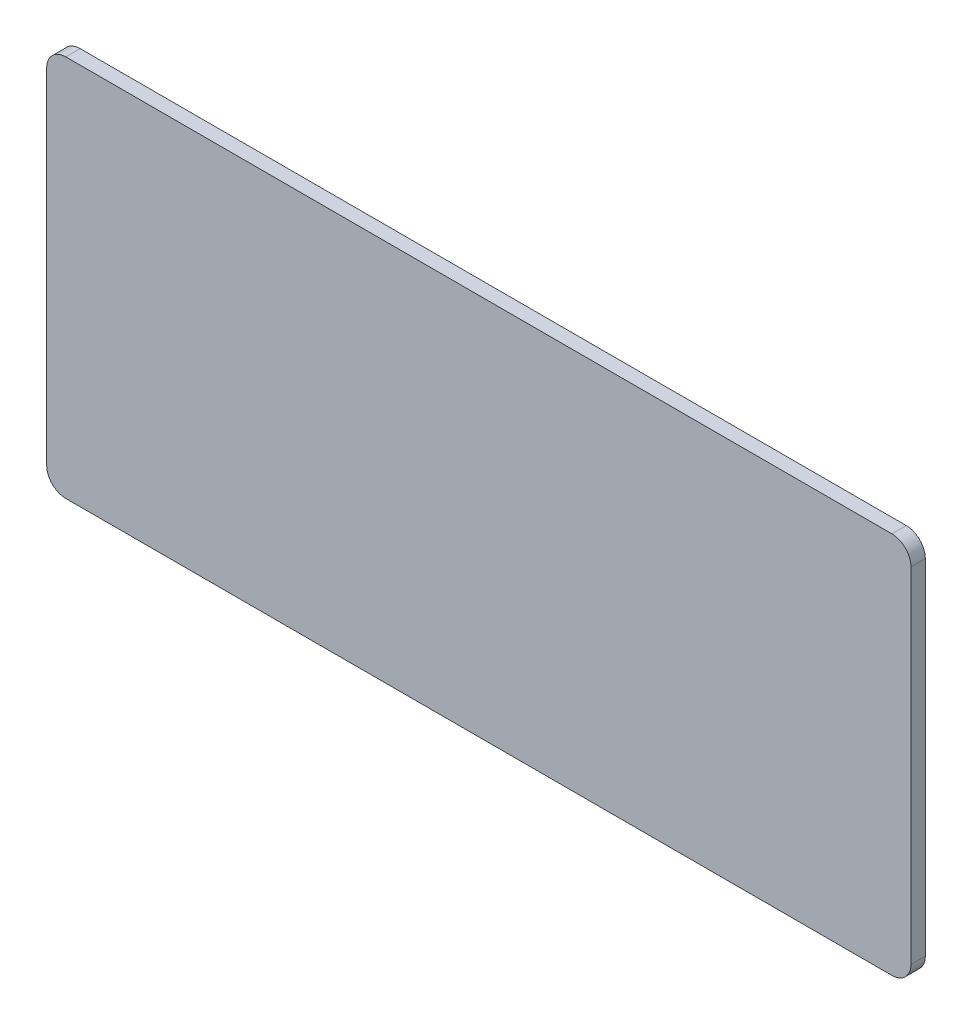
ISO-10303-21;
HEADER;
FILE_DESCRIPTION(('STEP AP214'),'2;1');
FILE_NAME('part.step','',(''),(''),'','','');
FILE_SCHEMA(('AUTOMOTIVE_DESIGN { 1 0 10303 214 1 1 1 1 }'));
ENDSEC;
DATA;
#1=APPLICATION_CONTEXT('core data for automotive mechanical design processes');
#2=APPLICATION_PROTOCOL_DEFINITION('international standard','automotive_design',2000,#1);
#3=PRODUCT_CONTEXT('',#1,'mechanical');
#4=PRODUCT('Part','Part','',(#3));
#5=PRODUCT_RELATED_PRODUCT_CATEGORY('part','',(#4));
#6=PRODUCT_DEFINITION_FORMATION('','',#4);
#7=PRODUCT_DEFINITION_CONTEXT('part definition',#1,'design');
#8=PRODUCT_DEFINITION('design','',#6,#7);
#9=PRODUCT_DEFINITION_SHAPE('','',#8);
#10=(LENGTH_UNIT() NAMED_UNIT(*) SI_UNIT(.MILLI.,.METRE.));
#11=(NAMED_UNIT(*) PLANE_ANGLE_UNIT() SI_UNIT($,.RADIAN.));
#12=(NAMED_UNIT(*) SI_UNIT($,.STERADIAN.) SOLID_ANGLE_UNIT());
#13=UNCERTAINTY_MEASURE_WITH_UNIT(LENGTH_MEASURE(1.E-05),#10,'distance_accuracy_value','');
#14=(GEOMETRIC_REPRESENTATION_CONTEXT(3) GLOBAL_UNCERTAINTY_ASSIGNED_CONTEXT((#13)) GLOBAL_UNIT_ASSIGNED_CONTEXT((#10,
#11,#12)) REPRESENTATION_CONTEXT('',''));
#15=CARTESIAN_POINT('',(0.,0.,0.));
#16=DIRECTION('',(0.,0.,1.));
#17=DIRECTION('',(1.,0.,0.));
#18=AXIS2_PLACEMENT_3D('',#15,#16,#17);
#19=CARTESIAN_POINT('',(0.,0.,-4.7625));
#20=DIRECTION('',(-1.,0.,0.));
#21=DIRECTION('',(0.,0.,1.));
#22=AXIS2_PLACEMENT_3D('',#19,#20,#21);
#23=PLANE('',#22);
#24=DIRECTION('',(0.,-1.,0.));
#25=VECTOR('',#24,1.);
#26=CARTESIAN_POINT('',(0.,0.,0.));
#27=LINE('',#26,#25);
#28=CARTESIAN_POINT('',(0.,120.65,0.));
#29=VERTEX_POINT('',#28);
#30=CARTESIAN_POINT('',(0.,6.35,0.));
#31=VERTEX_POINT('',#30);
#32=EDGE_CURVE('E157',#29,#31,#27,.T.);
#33=ORIENTED_EDGE('',*,*,#32,.F.);
#34=DIRECTION('',(0.,0.,1.));
#35=VECTOR('',#34,1.);
#36=CARTESIAN_POINT('',(0.,120.65,-4.7625));
#37=LINE('',#36,#35);
#38=CARTESIAN_POINT('',(0.,120.65,-4.7625));
#39=VERTEX_POINT('',#38);
#40=EDGE_CURVE('E127',#29,#39,#37,.F.);
#41=ORIENTED_EDGE('',*,*,#40,.T.);
#42=DIRECTION('',(0.,-1.,0.));
#43=VECTOR('',#42,1.);
#44=CARTESIAN_POINT('',(0.,0.,-4.7625));
#45=LINE('',#44,#43);
#46=CARTESIAN_POINT('',(0.,6.35,-4.7625));
#47=VERTEX_POINT('',#46);
#48=EDGE_CURVE('E151',#39,#47,#45,.T.);
#49=ORIENTED_EDGE('',*,*,#48,.T.);
#50=DIRECTION('',(0.,0.,1.));
#51=VECTOR('',#50,1.);
#52=CARTESIAN_POINT('',(0.,6.35,-4.7625));
#53=LINE('',#52,#51);
#54=EDGE_CURVE('E131',#47,#31,#53,.T.);
#55=ORIENTED_EDGE('',*,*,#54,.T.);
#56=EDGE_LOOP('',(#33,#41,#49,#55));
#57=FACE_BOUND('',#56,.T.);
#58=ADVANCED_FACE('F38',(#57),#23,.T.);
#59=CARTESIAN_POINT('',(287.02,0.,-4.7625));
#60=DIRECTION('',(1.,0.,0.));
#61=DIRECTION('',(0.,0.,-1.));
#62=AXIS2_PLACEMENT_3D('',#59,#60,#61);
#63=PLANE('',#62);
#64=DIRECTION('',(0.,1.,0.));
#65=VECTOR('',#64,1.);
#66=CARTESIAN_POINT('',(287.02,0.,0.));
#67=LINE('',#66,#65);
#68=CARTESIAN_POINT('',(287.02,6.35,0.));
#69=VERTEX_POINT('',#68);
#70=CARTESIAN_POINT('',(287.02,120.65,0.));
#71=VERTEX_POINT('',#70);
#72=EDGE_CURVE('E144',#69,#71,#67,.T.);
#73=ORIENTED_EDGE('',*,*,#72,.F.);
#74=DIRECTION('',(0.,0.,1.));
#75=VECTOR('',#74,1.);
#76=CARTESIAN_POINT('',(287.02,6.35,-4.7625));
#77=LINE('',#76,#75);
#78=CARTESIAN_POINT('',(287.02,6.35,-4.7625));
#79=VERTEX_POINT('',#78);
#80=EDGE_CURVE('E11',#69,#79,#77,.F.);
#81=ORIENTED_EDGE('',*,*,#80,.T.);
#82=DIRECTION('',(0.,1.,0.));
#83=VECTOR('',#82,1.);
#84=CARTESIAN_POINT('',(287.02,0.,-4.7625));
#85=LINE('',#84,#83);
#86=CARTESIAN_POINT('',(287.02,120.65,-4.7625));
#87=VERTEX_POINT('',#86);
#88=EDGE_CURVE('E116',#79,#87,#85,.T.);
#89=ORIENTED_EDGE('',*,*,#88,.T.);
#90=DIRECTION('',(0.,0.,1.));
#91=VECTOR('',#90,1.);
#92=CARTESIAN_POINT('',(287.02,120.65,0.));
#93=LINE('',#92,#91);
#94=EDGE_CURVE('E46',#87,#71,#93,.T.);
#95=ORIENTED_EDGE('',*,*,#94,.T.);
#96=EDGE_LOOP('',(#73,#81,#89,#95));
#97=FACE_BOUND('',#96,.T.);
#98=ADVANCED_FACE('F143',(#97),#63,.T.);
#99=CARTESIAN_POINT('',(0.,0.,-4.7625));
#100=DIRECTION('',(0.,-1.,0.));
#101=DIRECTION('',(0.,0.,-1.));
#102=AXIS2_PLACEMENT_3D('',#99,#100,#101);
#103=PLANE('',#102);
#104=DIRECTION('',(1.,0.,0.));
#105=VECTOR('',#104,1.);
#106=CARTESIAN_POINT('',(0.,0.,0.));
#107=LINE('',#106,#105);
#108=CARTESIAN_POINT('',(6.35,0.,0.));
#109=VERTEX_POINT('',#108);
#110=CARTESIAN_POINT('',(280.67,0.,0.));
#111=VERTEX_POINT('',#110);
#112=EDGE_CURVE('E152',#109,#111,#107,.T.);
#113=ORIENTED_EDGE('',*,*,#112,.F.);
#114=DIRECTION('',(0.,0.,1.));
#115=VECTOR('',#114,1.);
#116=CARTESIAN_POINT('',(6.35,0.,-4.7625));
#117=LINE('',#116,#115);
#118=CARTESIAN_POINT('',(6.35,0.,-4.7625));
#119=VERTEX_POINT('',#118);
#120=EDGE_CURVE('E60',#109,#119,#117,.F.);
#121=ORIENTED_EDGE('',*,*,#120,.T.);
#122=DIRECTION('',(1.,0.,0.));
#123=VECTOR('',#122,1.);
#124=CARTESIAN_POINT('',(0.,0.,-4.7625));
#125=LINE('',#124,#123);
#126=CARTESIAN_POINT('',(280.67,0.,-4.7625));
#127=VERTEX_POINT('',#126);
#128=EDGE_CURVE('E155',#119,#127,#125,.T.);
#129=ORIENTED_EDGE('',*,*,#128,.T.);
#130=DIRECTION('',(0.,0.,1.));
#131=VECTOR('',#130,1.);
#132=CARTESIAN_POINT('',(280.67,0.,-4.7625));
#133=LINE('',#132,#131);
#134=EDGE_CURVE('E137',#127,#111,#133,.T.);
#135=ORIENTED_EDGE('',*,*,#134,.T.);
#136=EDGE_LOOP('',(#113,#121,#129,#135));
#137=FACE_BOUND('',#136,.T.);
#138=ADVANCED_FACE('F179',(#137),#103,.T.);
#139=CARTESIAN_POINT('',(0.,0.,-4.7625));
#140=DIRECTION('',(0.,0.,-1.));
#141=DIRECTION('',(-1.,0.,0.));
#142=AXIS2_PLACEMENT_3D('',#139,#140,#141);
#143=PLANE('',#142);
#144=ORIENTED_EDGE('',*,*,#48,.F.);
#145=CARTESIAN_POINT('',(6.35000000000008,120.65,-4.7625));
#146=DIRECTION('',(0.,0.,-1.));
#147=DIRECTION('',(-1.,0.,0.));
#148=AXIS2_PLACEMENT_3D('',#145,#146,#147);
#149=CIRCLE('',#148,6.35);
#150=CARTESIAN_POINT('',(6.35000000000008,127.,-4.7625));
#151=VERTEX_POINT('',#150);
#152=EDGE_CURVE('E123',#39,#151,#149,.T.);
#153=ORIENTED_EDGE('',*,*,#152,.T.);
#154=DIRECTION('',(-1.,0.,0.));
#155=VECTOR('',#154,1.);
#156=CARTESIAN_POINT('',(287.02,127.,-4.7625));
#157=LINE('',#156,#155);
#158=CARTESIAN_POINT('',(280.67,127.,-4.7625));
#159=VERTEX_POINT('',#158);
#160=EDGE_CURVE('E109',#159,#151,#157,.T.);
#161=ORIENTED_EDGE('',*,*,#160,.F.);
#162=CARTESIAN_POINT('',(280.67,120.65,-4.7625));
#163=DIRECTION('',(0.,0.,-1.));
#164=DIRECTION('',(-1.,0.,0.));
#165=AXIS2_PLACEMENT_3D('',#162,#163,#164);
#166=CIRCLE('',#165,6.35);
#167=EDGE_CURVE('E120',#159,#87,#166,.T.);
#168=ORIENTED_EDGE('',*,*,#167,.T.);
#169=ORIENTED_EDGE('',*,*,#88,.F.);
#170=CARTESIAN_POINT('',(280.67,6.35,-4.7625));
#171=DIRECTION('',(0.,0.,-1.));
#172=DIRECTION('',(-1.,0.,0.));
#173=AXIS2_PLACEMENT_3D('',#170,#171,#172);
#174=CIRCLE('',#173,6.35);
#175=EDGE_CURVE('E53',#79,#127,#174,.T.);
#176=ORIENTED_EDGE('',*,*,#175,.T.);
#177=ORIENTED_EDGE('',*,*,#128,.F.);
#178=CARTESIAN_POINT('',(6.35,6.35,-4.7625));
#179=DIRECTION('',(0.,0.,-1.));
#180=DIRECTION('',(-1.,0.,0.));
#181=AXIS2_PLACEMENT_3D('',#178,#179,#180);
#182=CIRCLE('',#181,6.35);
#183=EDGE_CURVE('E129',#119,#47,#182,.T.);
#184=ORIENTED_EDGE('',*,*,#183,.T.);
#185=EDGE_LOOP('',(#144,#153,#161,#168,#169,#176,#177,#184));
#186=FACE_BOUND('',#185,.T.);
#187=ADVANCED_FACE('F119',(#186),#143,.T.);
#188=CARTESIAN_POINT('',(0.,0.,0.));
#189=DIRECTION('',(0.,0.,-1.));
#190=DIRECTION('',(-1.,0.,0.));
#191=AXIS2_PLACEMENT_3D('',#188,#189,#190);
#192=PLANE('',#191);
#193=DIRECTION('',(-1.,0.,0.));
#194=VECTOR('',#193,1.);
#195=CARTESIAN_POINT('',(287.02,127.,0.));
#196=LINE('',#195,#194);
#197=CARTESIAN_POINT('',(280.67,127.,0.));
#198=VERTEX_POINT('',#197);
#199=CARTESIAN_POINT('',(6.35000000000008,127.,0.));
#200=VERTEX_POINT('',#199);
#201=EDGE_CURVE('E112',#198,#200,#196,.T.);
#202=ORIENTED_EDGE('',*,*,#201,.T.);
#203=CARTESIAN_POINT('',(6.35000000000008,120.65,0.));
#204=DIRECTION('',(0.,0.,-1.));
#205=DIRECTION('',(-1.,0.,0.));
#206=AXIS2_PLACEMENT_3D('',#203,#204,#205);
#207=CIRCLE('',#206,6.35);
#208=EDGE_CURVE('E166',#200,#29,#207,.F.);
#209=ORIENTED_EDGE('',*,*,#208,.T.);
#210=ORIENTED_EDGE('',*,*,#32,.T.);
#211=CARTESIAN_POINT('',(6.35,6.35,0.));
#212=DIRECTION('',(0.,0.,-1.));
#213=DIRECTION('',(-1.,0.,0.));
#214=AXIS2_PLACEMENT_3D('',#211,#212,#213);
#215=CIRCLE('',#214,6.35);
#216=EDGE_CURVE('E164',#31,#109,#215,.F.);
#217=ORIENTED_EDGE('',*,*,#216,.T.);
#218=ORIENTED_EDGE('',*,*,#112,.T.);
#219=CARTESIAN_POINT('',(280.67,6.35,0.));
#220=DIRECTION('',(0.,0.,-1.));
#221=DIRECTION('',(-1.,0.,0.));
#222=AXIS2_PLACEMENT_3D('',#219,#220,#221);
#223=CIRCLE('',#222,6.35);
#224=EDGE_CURVE('E150',#111,#69,#223,.F.);
#225=ORIENTED_EDGE('',*,*,#224,.T.);
#226=ORIENTED_EDGE('',*,*,#72,.T.);
#227=CARTESIAN_POINT('',(280.67,120.65,0.));
#228=DIRECTION('',(0.,0.,-1.));
#229=DIRECTION('',(-1.,0.,0.));
#230=AXIS2_PLACEMENT_3D('',#227,#228,#229);
#231=CIRCLE('',#230,6.35);
#232=EDGE_CURVE('E148',#71,#198,#231,.F.);
#233=ORIENTED_EDGE('',*,*,#232,.T.);
#234=EDGE_LOOP('',(#202,#209,#210,#217,#218,#225,#226,#233));
#235=FACE_BOUND('',#234,.T.);
#236=ADVANCED_FACE('F147',(#235),#192,.F.);
#237=CARTESIAN_POINT('',(287.02,127.,0.));
#238=DIRECTION('',(0.,-1.,0.));
#239=DIRECTION('',(0.,0.,-1.));
#240=AXIS2_PLACEMENT_3D('',#237,#238,#239);
#241=PLANE('',#240);
#242=ORIENTED_EDGE('',*,*,#160,.T.);
#243=DIRECTION('',(0.,0.,1.));
#244=VECTOR('',#243,1.);
#245=CARTESIAN_POINT('',(6.35000000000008,127.,0.));
#246=LINE('',#245,#244);
#247=EDGE_CURVE('E115',#151,#200,#246,.T.);
#248=ORIENTED_EDGE('',*,*,#247,.T.);
#249=ORIENTED_EDGE('',*,*,#201,.F.);
#250=DIRECTION('',(0.,0.,1.));
#251=VECTOR('',#250,1.);
#252=CARTESIAN_POINT('',(280.67,127.,-4.7625));
#253=LINE('',#252,#251);
#254=EDGE_CURVE('E105',#198,#159,#253,.F.);
#255=ORIENTED_EDGE('',*,*,#254,.T.);
#256=EDGE_LOOP('',(#242,#248,#249,#255));
#257=FACE_BOUND('',#256,.T.);
#258=ADVANCED_FACE('F107',(#257),#241,.F.);
#259=CARTESIAN_POINT('',(6.35000000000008,120.65,0.));
#260=DIRECTION('',(0.,0.,-1.));
#261=DIRECTION('',(-1.,0.,0.));
#262=AXIS2_PLACEMENT_3D('',#259,#260,#261);
#263=CYLINDRICAL_SURFACE('',#262,6.35);
#264=ORIENTED_EDGE('',*,*,#152,.F.);
#265=ORIENTED_EDGE('',*,*,#40,.F.);
#266=ORIENTED_EDGE('',*,*,#208,.F.);
#267=ORIENTED_EDGE('',*,*,#247,.F.);
#268=EDGE_LOOP('',(#264,#265,#266,#267));
#269=FACE_BOUND('',#268,.T.);
#270=ADVANCED_FACE('F188',(#269),#263,.T.);
#271=CARTESIAN_POINT('',(6.35,6.35,-4.7625));
#272=DIRECTION('',(0.,0.,1.));
#273=DIRECTION('',(1.,0.,0.));
#274=AXIS2_PLACEMENT_3D('',#271,#272,#273);
#275=CYLINDRICAL_SURFACE('',#274,6.35);
#276=ORIENTED_EDGE('',*,*,#183,.F.);
#277=ORIENTED_EDGE('',*,*,#120,.F.);
#278=ORIENTED_EDGE('',*,*,#216,.F.);
#279=ORIENTED_EDGE('',*,*,#54,.F.);
#280=EDGE_LOOP('',(#276,#277,#278,#279));
#281=FACE_BOUND('',#280,.T.);
#282=ADVANCED_FACE('F183',(#281),#275,.T.);
#283=CARTESIAN_POINT('',(280.67,6.35,-4.7625));
#284=DIRECTION('',(0.,0.,1.));
#285=DIRECTION('',(1.,0.,0.));
#286=AXIS2_PLACEMENT_3D('',#283,#284,#285);
#287=CYLINDRICAL_SURFACE('',#286,6.35);
#288=ORIENTED_EDGE('',*,*,#175,.F.);
#289=ORIENTED_EDGE('',*,*,#80,.F.);
#290=ORIENTED_EDGE('',*,*,#224,.F.);
#291=ORIENTED_EDGE('',*,*,#134,.F.);
#292=EDGE_LOOP('',(#288,#289,#290,#291));
#293=FACE_BOUND('',#292,.T.);
#294=ADVANCED_FACE('F181',(#293),#287,.T.);
#295=CARTESIAN_POINT('',(280.67,120.65,-4.7625));
#296=DIRECTION('',(0.,0.,-1.));
#297=DIRECTION('',(-1.,0.,0.));
#298=AXIS2_PLACEMENT_3D('',#295,#296,#297);
#299=CYLINDRICAL_SURFACE('',#298,6.35);
#300=ORIENTED_EDGE('',*,*,#167,.F.);
#301=ORIENTED_EDGE('',*,*,#254,.F.);
#302=ORIENTED_EDGE('',*,*,#232,.F.);
#303=ORIENTED_EDGE('',*,*,#94,.F.);
#304=EDGE_LOOP('',(#300,#301,#302,#303));
#305=FACE_BOUND('',#304,.T.);
#306=ADVANCED_FACE('F40',(#305),#299,.T.);
#307=CLOSED_SHELL('',(#58,#98,#138,#187,#236,#258,#270,#282,#294,#306));
#308=MANIFOLD_SOLID_BREP('B2',#307);
#309=ADVANCED_BREP_SHAPE_REPRESENTATION('',(#18,#308),#14);
#310=SHAPE_DEFINITION_REPRESENTATION(#9,#309);
ENDSEC;
END-ISO-10303-21;
